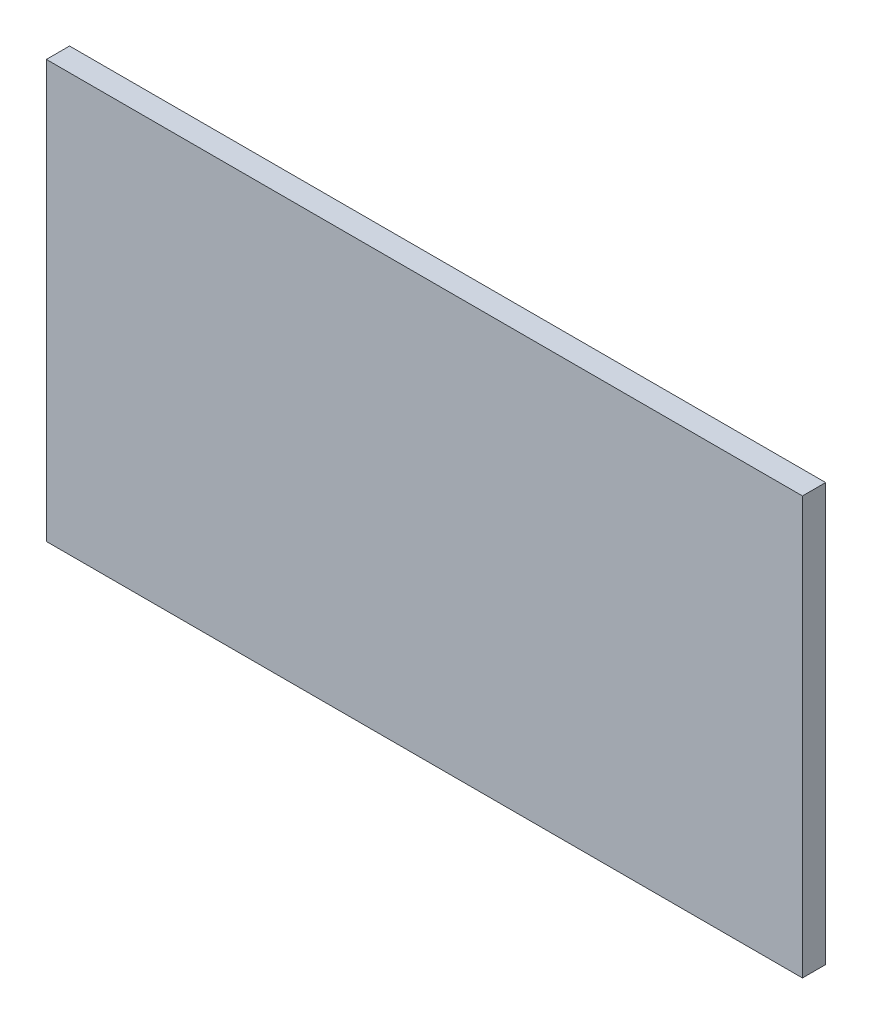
from build123d import *

# Parameters (mm, degrees)
ESQUISSE1_W        = 3260
ESQUISSE1_H        = 1800
BOSS_EXTRU_1_DEPTH = 100


with BuildPart() as part:
    # Esquisse1 → Boss.-Extru.1 (new body)
    with BuildSketch(Plane.XY):
        with Locations((-1630, 900)):
            Rectangle(ESQUISSE1_W, ESQUISSE1_H)
    extrude(amount=-BOSS_EXTRU_1_DEPTH)


solid = part.part
